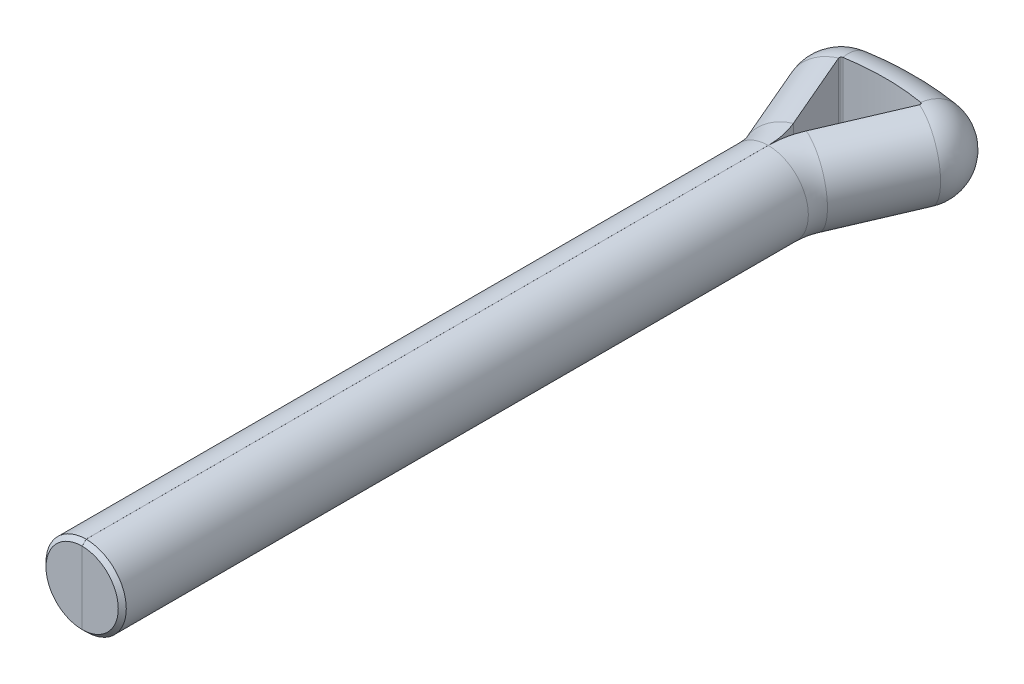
from build123d import *

# Parameters (mm, degrees)
CUT_EXTRUDE1_REACH = 23.12
SKETCH3_W          = 0.001
SKETCH3_H          = 2
CHAMFER1_SIZE      = 0.1


with BuildPart() as part:
    # Sweep3: sweep along a path in Sketch2
    with BuildLine(Plane(origin=(0, 0, 0), x_dir=(1, 0, 0), z_dir=(0, 1, 0))) as sweep3_path:
        Line((0, 0), (0, 17.089286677))
        ThreePointArc((0, 17.089286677), (0.040882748, 17.491604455), (0.161859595, 17.877474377))
        Line((0.161859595, 17.877474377), (1.007749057, 19.850181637))
        ThreePointArc((1.007749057, 19.850181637), (1.005680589, 19.893846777), (0.970067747, 19.919197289))
        ThreePointArc((0.970067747, 19.919197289), (0.4867136, 19.979764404), (0, 20))
    # Sketch1 → Sweep3 (sweep)
    with BuildSketch(Plane.XY):
        with BuildLine():
            Line((0, 1), (0, -1))
            ThreePointArc((0, -1), (1, 0), (0, 1))
        make_face()
    sweep3 = sweep(path=sweep3_path.line)

    # Mirror1: Sweep3 across plane
    add(sweep3.mirror(Plane(origin=(0, 0, 0), x_dir=(0, 0, 1), z_dir=(1, 0, 0))))

    # Sketch3 → Cut-Extrude1 (cut, up to next)
    with BuildSketch(Plane.XY, mode=Mode.PRIVATE) as cut_extrude1_sk1:
        Rectangle(SKETCH3_W, SKETCH3_H)
    cut_extrude1_tool1 = extrude(cut_extrude1_sk1.sketch, amount=-CUT_EXTRUDE1_REACH, mode=Mode.PRIVATE) & part.part
    add(cut_extrude1_tool1.solids().sort_by_distance((0, 0, 0))[0], mode=Mode.SUBTRACT)

    # Chamfer1
    chamfer1_edges = [part.edges().sort_by_distance(p)[0] for p in [
        (-1, 0, 0),
        (1, 0, 0),
    ]]
    chamfer(chamfer1_edges, length=CHAMFER1_SIZE)


solid = part.part
